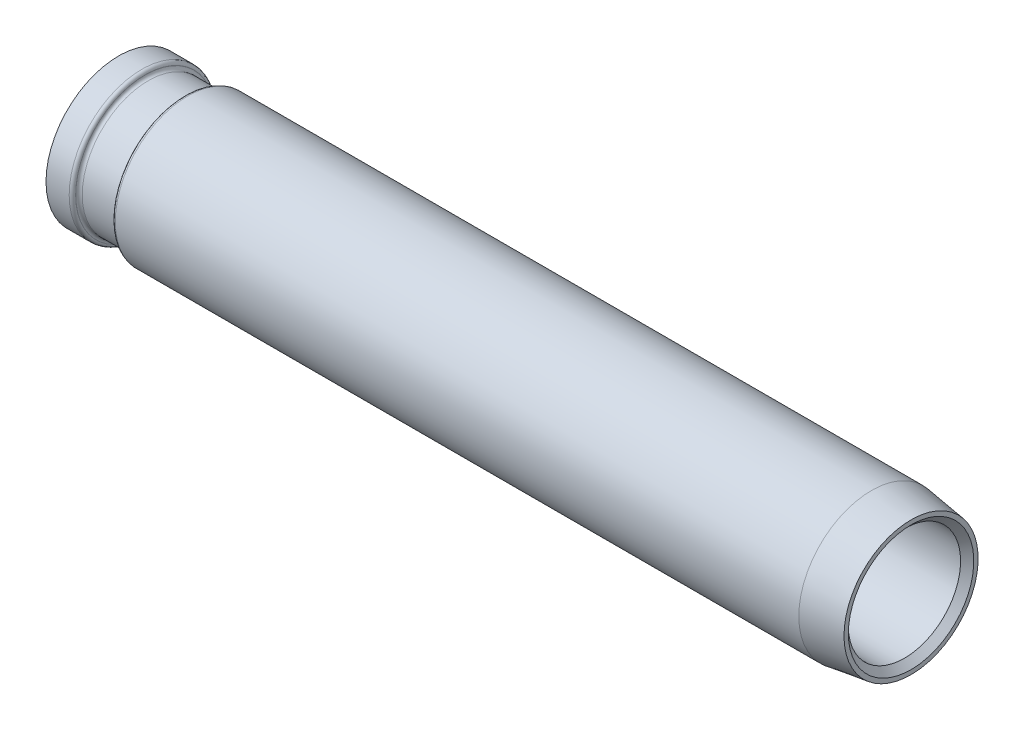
ISO-10303-21;
HEADER;
FILE_DESCRIPTION(('STEP AP214'),'2;1');
FILE_NAME('part.step','',(''),(''),'','','');
FILE_SCHEMA(('AUTOMOTIVE_DESIGN { 1 0 10303 214 1 1 1 1 }'));
ENDSEC;
DATA;
#1=APPLICATION_CONTEXT('core data for automotive mechanical design processes');
#2=APPLICATION_PROTOCOL_DEFINITION('international standard','automotive_design',2000,#1);
#3=PRODUCT_CONTEXT('',#1,'mechanical');
#4=PRODUCT('Part','Part','',(#3));
#5=PRODUCT_RELATED_PRODUCT_CATEGORY('part','',(#4));
#6=PRODUCT_DEFINITION_FORMATION('','',#4);
#7=PRODUCT_DEFINITION_CONTEXT('part definition',#1,'design');
#8=PRODUCT_DEFINITION('design','',#6,#7);
#9=PRODUCT_DEFINITION_SHAPE('','',#8);
#10=(LENGTH_UNIT() NAMED_UNIT(*) SI_UNIT(.MILLI.,.METRE.));
#11=(NAMED_UNIT(*) PLANE_ANGLE_UNIT() SI_UNIT($,.RADIAN.));
#12=(NAMED_UNIT(*) SI_UNIT($,.STERADIAN.) SOLID_ANGLE_UNIT());
#13=UNCERTAINTY_MEASURE_WITH_UNIT(LENGTH_MEASURE(1.E-05),#10,'distance_accuracy_value','');
#14=(GEOMETRIC_REPRESENTATION_CONTEXT(3) GLOBAL_UNCERTAINTY_ASSIGNED_CONTEXT((#13)) GLOBAL_UNIT_ASSIGNED_CONTEXT((#10,
#11,#12)) REPRESENTATION_CONTEXT('',''));
#15=CARTESIAN_POINT('',(0.,0.,0.));
#16=DIRECTION('',(0.,0.,1.));
#17=DIRECTION('',(1.,0.,0.));
#18=AXIS2_PLACEMENT_3D('',#15,#16,#17);
#19=CARTESIAN_POINT('',(-100.055405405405,0.,0.));
#20=DIRECTION('',(-1.,0.,0.));
#21=DIRECTION('',(0.,0.,1.));
#22=AXIS2_PLACEMENT_3D('',#19,#20,#21);
#23=CYLINDRICAL_SURFACE('',#22,8.5);
#24=CARTESIAN_POINT('',(-47.3474774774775,0.,0.));
#25=DIRECTION('',(1.,0.,0.));
#26=DIRECTION('',(0.,0.,-1.));
#27=AXIS2_PLACEMENT_3D('',#24,#25,#26);
#28=CIRCLE('',#27,8.5);
#29=CARTESIAN_POINT('',(-47.3474774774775,0.,-8.5));
#30=VERTEX_POINT('',#29);
#31=EDGE_CURVE('E55',#30,#30,#28,.F.);
#32=ORIENTED_EDGE('',*,*,#31,.T.);
#33=EDGE_LOOP('',(#32));
#34=FACE_BOUND('',#33,.T.);
#35=CARTESIAN_POINT('',(-44.8374774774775,0.,0.));
#36=DIRECTION('',(-1.,0.,0.));
#37=DIRECTION('',(0.,0.,1.));
#38=AXIS2_PLACEMENT_3D('',#35,#36,#37);
#39=CIRCLE('',#38,8.5);
#40=CARTESIAN_POINT('',(-44.8374774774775,0.,8.5));
#41=VERTEX_POINT('',#40);
#42=EDGE_CURVE('E106',#41,#41,#39,.T.);
#43=ORIENTED_EDGE('',*,*,#42,.F.);
#44=EDGE_LOOP('',(#43));
#45=FACE_BOUND('',#44,.T.);
#46=ADVANCED_FACE('F33',(#34,#45),#23,.F.);
#47=CARTESIAN_POINT('',(-48.3474774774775,11.,0.));
#48=DIRECTION('',(1.,0.,0.));
#49=DIRECTION('',(0.,0.,-1.));
#50=AXIS2_PLACEMENT_3D('',#47,#48,#49);
#51=PLANE('',#50);
#52=CARTESIAN_POINT('',(-48.3474774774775,0.,0.));
#53=DIRECTION('',(1.,0.,0.));
#54=DIRECTION('',(0.,0.,-1.));
#55=AXIS2_PLACEMENT_3D('',#52,#53,#54);
#56=CIRCLE('',#55,9.49999999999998);
#57=CARTESIAN_POINT('',(-48.3474774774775,0.,-9.49999999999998));
#58=VERTEX_POINT('',#57);
#59=EDGE_CURVE('E52',#58,#58,#56,.T.);
#60=ORIENTED_EDGE('',*,*,#59,.T.);
#61=EDGE_LOOP('',(#60));
#62=FACE_BOUND('',#61,.T.);
#63=CARTESIAN_POINT('',(-48.3474774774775,0.,0.));
#64=DIRECTION('',(-1.,0.,0.));
#65=DIRECTION('',(0.,0.,1.));
#66=AXIS2_PLACEMENT_3D('',#63,#64,#65);
#67=CIRCLE('',#66,11.);
#68=CARTESIAN_POINT('',(-48.3474774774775,0.,11.));
#69=VERTEX_POINT('',#68);
#70=EDGE_CURVE('E58',#69,#69,#67,.T.);
#71=ORIENTED_EDGE('',*,*,#70,.T.);
#72=EDGE_LOOP('',(#71));
#73=FACE_BOUND('',#72,.T.);
#74=ADVANCED_FACE('F113',(#62,#73),#51,.F.);
#75=CARTESIAN_POINT('',(-100.055405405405,0.,0.));
#76=DIRECTION('',(-1.,0.,0.));
#77=DIRECTION('',(0.,0.,1.));
#78=AXIS2_PLACEMENT_3D('',#75,#76,#77);
#79=CYLINDRICAL_SURFACE('',#78,11.);
#80=ORIENTED_EDGE('',*,*,#70,.F.);
#81=EDGE_LOOP('',(#80));
#82=FACE_BOUND('',#81,.T.);
#83=CARTESIAN_POINT('',(-44.8374774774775,0.,0.));
#84=DIRECTION('',(-1.,0.,0.));
#85=DIRECTION('',(0.,0.,1.));
#86=AXIS2_PLACEMENT_3D('',#83,#84,#85);
#87=CIRCLE('',#86,11.);
#88=CARTESIAN_POINT('',(-44.8374774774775,0.,11.));
#89=VERTEX_POINT('',#88);
#90=EDGE_CURVE('E61',#89,#89,#87,.T.);
#91=ORIENTED_EDGE('',*,*,#90,.T.);
#92=EDGE_LOOP('',(#91));
#93=FACE_BOUND('',#92,.T.);
#94=ADVANCED_FACE('F118',(#82,#93),#79,.T.);
#95=CARTESIAN_POINT('',(-44.8374774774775,0.,0.));
#96=DIRECTION('',(-1.,0.,0.));
#97=DIRECTION('',(0.,0.,1.));
#98=AXIS2_PLACEMENT_3D('',#95,#96,#97);
#99=TOROIDAL_SURFACE('',#98,10.51,0.489999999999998);
#100=ORIENTED_EDGE('',*,*,#90,.F.);
#101=EDGE_LOOP('',(#100));
#102=FACE_BOUND('',#101,.T.);
#103=CARTESIAN_POINT('',(-44.3474774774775,0.,0.));
#104=DIRECTION('',(-1.,0.,0.));
#105=DIRECTION('',(0.,0.,1.));
#106=AXIS2_PLACEMENT_3D('',#103,#104,#105);
#107=CIRCLE('',#106,10.51);
#108=CARTESIAN_POINT('',(-44.3474774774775,0.,10.51));
#109=VERTEX_POINT('',#108);
#110=EDGE_CURVE('E64',#109,#109,#107,.T.);
#111=ORIENTED_EDGE('',*,*,#110,.T.);
#112=EDGE_LOOP('',(#111));
#113=FACE_BOUND('',#112,.T.);
#114=ADVANCED_FACE('F196',(#102,#113),#99,.T.);
#115=CARTESIAN_POINT('',(-44.3474774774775,10.51,0.));
#116=DIRECTION('',(-1.,0.,0.));
#117=DIRECTION('',(0.,0.,1.));
#118=AXIS2_PLACEMENT_3D('',#115,#116,#117);
#119=PLANE('',#118);
#120=ORIENTED_EDGE('',*,*,#110,.F.);
#121=EDGE_LOOP('',(#120));
#122=FACE_BOUND('',#121,.T.);
#123=CARTESIAN_POINT('',(-44.3474774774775,0.,0.));
#124=DIRECTION('',(-1.,0.,0.));
#125=DIRECTION('',(0.,0.,1.));
#126=AXIS2_PLACEMENT_3D('',#123,#124,#125);
#127=CIRCLE('',#126,10.49);
#128=CARTESIAN_POINT('',(-44.3474774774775,0.,10.49));
#129=VERTEX_POINT('',#128);
#130=EDGE_CURVE('E67',#129,#129,#127,.T.);
#131=ORIENTED_EDGE('',*,*,#130,.T.);
#132=EDGE_LOOP('',(#131));
#133=FACE_BOUND('',#132,.T.);
#134=ADVANCED_FACE('F192',(#122,#133),#119,.F.);
#135=CARTESIAN_POINT('',(-43.8574774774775,0.,0.));
#136=DIRECTION('',(-1.,0.,0.));
#137=DIRECTION('',(0.,0.,1.));
#138=AXIS2_PLACEMENT_3D('',#135,#136,#137);
#139=TOROIDAL_SURFACE('',#138,10.49,0.489999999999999);
#140=ORIENTED_EDGE('',*,*,#130,.F.);
#141=EDGE_LOOP('',(#140));
#142=FACE_BOUND('',#141,.T.);
#143=CARTESIAN_POINT('',(-43.8574774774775,0.,0.));
#144=DIRECTION('',(-1.,0.,0.));
#145=DIRECTION('',(0.,0.,1.));
#146=AXIS2_PLACEMENT_3D('',#143,#144,#145);
#147=CIRCLE('',#146,10.);
#148=CARTESIAN_POINT('',(-43.8574774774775,0.,10.));
#149=VERTEX_POINT('',#148);
#150=EDGE_CURVE('E70',#149,#149,#147,.T.);
#151=ORIENTED_EDGE('',*,*,#150,.T.);
#152=EDGE_LOOP('',(#151));
#153=FACE_BOUND('',#152,.T.);
#154=ADVANCED_FACE('F188',(#142,#153),#139,.F.);
#155=CARTESIAN_POINT('',(-100.055405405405,0.,0.));
#156=DIRECTION('',(-1.,0.,0.));
#157=DIRECTION('',(0.,0.,1.));
#158=AXIS2_PLACEMENT_3D('',#155,#156,#157);
#159=CYLINDRICAL_SURFACE('',#158,10.);
#160=ORIENTED_EDGE('',*,*,#150,.F.);
#161=EDGE_LOOP('',(#160));
#162=FACE_BOUND('',#161,.T.);
#163=CARTESIAN_POINT('',(-38.8374774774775,0.,0.));
#164=DIRECTION('',(-1.,0.,0.));
#165=DIRECTION('',(0.,0.,1.));
#166=AXIS2_PLACEMENT_3D('',#163,#164,#165);
#167=CIRCLE('',#166,10.);
#168=CARTESIAN_POINT('',(-38.8374774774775,0.,10.));
#169=VERTEX_POINT('',#168);
#170=EDGE_CURVE('E73',#169,#169,#167,.T.);
#171=ORIENTED_EDGE('',*,*,#170,.T.);
#172=EDGE_LOOP('',(#171));
#173=FACE_BOUND('',#172,.T.);
#174=ADVANCED_FACE('F184',(#162,#173),#159,.T.);
#175=CARTESIAN_POINT('',(-38.8374774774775,0.,0.));
#176=DIRECTION('',(-1.,0.,0.));
#177=DIRECTION('',(0.,0.,1.));
#178=AXIS2_PLACEMENT_3D('',#175,#176,#177);
#179=TOROIDAL_SURFACE('',#178,10.49,0.489999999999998);
#180=ORIENTED_EDGE('',*,*,#170,.F.);
#181=EDGE_LOOP('',(#180));
#182=FACE_BOUND('',#181,.T.);
#183=CARTESIAN_POINT('',(-38.3474774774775,0.,0.));
#184=DIRECTION('',(-1.,0.,0.));
#185=DIRECTION('',(0.,0.,1.));
#186=AXIS2_PLACEMENT_3D('',#183,#184,#185);
#187=CIRCLE('',#186,10.49);
#188=CARTESIAN_POINT('',(-38.3474774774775,0.,10.49));
#189=VERTEX_POINT('',#188);
#190=EDGE_CURVE('E76',#189,#189,#187,.T.);
#191=ORIENTED_EDGE('',*,*,#190,.T.);
#192=EDGE_LOOP('',(#191));
#193=FACE_BOUND('',#192,.T.);
#194=ADVANCED_FACE('F180',(#182,#193),#179,.F.);
#195=CARTESIAN_POINT('',(-38.3474774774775,10.51,0.));
#196=DIRECTION('',(1.,0.,0.));
#197=DIRECTION('',(0.,0.,-1.));
#198=AXIS2_PLACEMENT_3D('',#195,#196,#197);
#199=PLANE('',#198);
#200=ORIENTED_EDGE('',*,*,#190,.F.);
#201=EDGE_LOOP('',(#200));
#202=FACE_BOUND('',#201,.T.);
#203=CARTESIAN_POINT('',(-38.3474774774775,0.,0.));
#204=DIRECTION('',(-1.,0.,0.));
#205=DIRECTION('',(0.,0.,1.));
#206=AXIS2_PLACEMENT_3D('',#203,#204,#205);
#207=CIRCLE('',#206,10.51);
#208=CARTESIAN_POINT('',(-38.3474774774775,0.,10.51));
#209=VERTEX_POINT('',#208);
#210=EDGE_CURVE('E79',#209,#209,#207,.T.);
#211=ORIENTED_EDGE('',*,*,#210,.T.);
#212=EDGE_LOOP('',(#211));
#213=FACE_BOUND('',#212,.T.);
#214=ADVANCED_FACE('F176',(#202,#213),#199,.F.);
#215=CARTESIAN_POINT('',(-37.8574774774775,0.,0.));
#216=DIRECTION('',(-1.,0.,0.));
#217=DIRECTION('',(0.,0.,1.));
#218=AXIS2_PLACEMENT_3D('',#215,#216,#217);
#219=TOROIDAL_SURFACE('',#218,10.51,0.489999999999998);
#220=ORIENTED_EDGE('',*,*,#210,.F.);
#221=EDGE_LOOP('',(#220));
#222=FACE_BOUND('',#221,.T.);
#223=CARTESIAN_POINT('',(-37.8574774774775,0.,0.));
#224=DIRECTION('',(-1.,0.,0.));
#225=DIRECTION('',(0.,0.,1.));
#226=AXIS2_PLACEMENT_3D('',#223,#224,#225);
#227=CIRCLE('',#226,11.);
#228=CARTESIAN_POINT('',(-37.8574774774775,0.,11.));
#229=VERTEX_POINT('',#228);
#230=EDGE_CURVE('E82',#229,#229,#227,.T.);
#231=ORIENTED_EDGE('',*,*,#230,.T.);
#232=EDGE_LOOP('',(#231));
#233=FACE_BOUND('',#232,.T.);
#234=ADVANCED_FACE('F173',(#222,#233),#219,.T.);
#235=CARTESIAN_POINT('',(-100.055405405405,0.,0.));
#236=DIRECTION('',(-1.,0.,0.));
#237=DIRECTION('',(0.,0.,1.));
#238=AXIS2_PLACEMENT_3D('',#235,#236,#237);
#239=CYLINDRICAL_SURFACE('',#238,11.);
#240=CARTESIAN_POINT('',(65.6525225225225,0.,0.));
#241=DIRECTION('',(-1.,0.,0.));
#242=DIRECTION('',(0.,0.,1.));
#243=AXIS2_PLACEMENT_3D('',#240,#241,#242);
#244=CIRCLE('',#243,11.);
#245=CARTESIAN_POINT('',(65.6525225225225,0.,11.));
#246=VERTEX_POINT('',#245);
#247=EDGE_CURVE('E39',#246,#246,#244,.T.);
#248=ORIENTED_EDGE('',*,*,#247,.T.);
#249=EDGE_LOOP('',(#248));
#250=FACE_BOUND('',#249,.T.);
#251=ORIENTED_EDGE('',*,*,#230,.F.);
#252=EDGE_LOOP('',(#251));
#253=FACE_BOUND('',#252,.T.);
#254=ADVANCED_FACE('F170',(#250,#253),#239,.T.);
#255=CARTESIAN_POINT('',(71.6525225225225,11.,0.));
#256=DIRECTION('',(-1.,0.,0.));
#257=DIRECTION('',(0.,0.,1.));
#258=AXIS2_PLACEMENT_3D('',#255,#256,#257);
#259=PLANE('',#258);
#260=CARTESIAN_POINT('',(71.6525225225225,0.,0.));
#261=DIRECTION('',(-1.,0.,0.));
#262=DIRECTION('',(0.,0.,1.));
#263=AXIS2_PLACEMENT_3D('',#260,#261,#262);
#264=CIRCLE('',#263,10.1567549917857);
#265=CARTESIAN_POINT('',(71.6525225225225,0.,10.1567549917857));
#266=VERTEX_POINT('',#265);
#267=EDGE_CURVE('E10',#266,#266,#264,.F.);
#268=ORIENTED_EDGE('',*,*,#267,.T.);
#269=EDGE_LOOP('',(#268));
#270=FACE_BOUND('',#269,.T.);
#271=CARTESIAN_POINT('',(71.6525225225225,0.,0.));
#272=DIRECTION('',(-1.,0.,0.));
#273=DIRECTION('',(0.,0.,1.));
#274=AXIS2_PLACEMENT_3D('',#271,#272,#273);
#275=CIRCLE('',#274,9.49999999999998);
#276=CARTESIAN_POINT('',(71.6525225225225,0.,9.49999999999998));
#277=VERTEX_POINT('',#276);
#278=EDGE_CURVE('E47',#277,#277,#275,.T.);
#279=ORIENTED_EDGE('',*,*,#278,.T.);
#280=EDGE_LOOP('',(#279));
#281=FACE_BOUND('',#280,.T.);
#282=ADVANCED_FACE('F166',(#270,#281),#259,.F.);
#283=CARTESIAN_POINT('',(-100.055405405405,0.,0.));
#284=DIRECTION('',(-1.,0.,0.));
#285=DIRECTION('',(0.,0.,1.));
#286=AXIS2_PLACEMENT_3D('',#283,#284,#285);
#287=CYLINDRICAL_SURFACE('',#286,8.5);
#288=CARTESIAN_POINT('',(70.6525225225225,0.,0.));
#289=DIRECTION('',(-1.,0.,0.));
#290=DIRECTION('',(0.,0.,1.));
#291=AXIS2_PLACEMENT_3D('',#288,#289,#290);
#292=CIRCLE('',#291,8.5);
#293=CARTESIAN_POINT('',(70.6525225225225,0.,8.5));
#294=VERTEX_POINT('',#293);
#295=EDGE_CURVE('E43',#294,#294,#292,.F.);
#296=ORIENTED_EDGE('',*,*,#295,.T.);
#297=EDGE_LOOP('',(#296));
#298=FACE_BOUND('',#297,.T.);
#299=CARTESIAN_POINT('',(-37.8474774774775,0.,0.));
#300=DIRECTION('',(-1.,0.,0.));
#301=DIRECTION('',(0.,0.,1.));
#302=AXIS2_PLACEMENT_3D('',#299,#300,#301);
#303=CIRCLE('',#302,8.5);
#304=CARTESIAN_POINT('',(-37.8474774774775,0.,8.5));
#305=VERTEX_POINT('',#304);
#306=EDGE_CURVE('E85',#305,#305,#303,.T.);
#307=ORIENTED_EDGE('',*,*,#306,.T.);
#308=EDGE_LOOP('',(#307));
#309=FACE_BOUND('',#308,.T.);
#310=ADVANCED_FACE('F162',(#298,#309),#287,.F.);
#311=CARTESIAN_POINT('',(-37.8474774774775,0.,0.));
#312=DIRECTION('',(-1.,0.,0.));
#313=DIRECTION('',(0.,0.,1.));
#314=AXIS2_PLACEMENT_3D('',#311,#312,#313);
#315=TOROIDAL_SURFACE('',#314,8.,0.500000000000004);
#316=ORIENTED_EDGE('',*,*,#306,.F.);
#317=EDGE_LOOP('',(#316));
#318=FACE_BOUND('',#317,.T.);
#319=CARTESIAN_POINT('',(-38.3474774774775,0.,0.));
#320=DIRECTION('',(-1.,0.,0.));
#321=DIRECTION('',(0.,0.,1.));
#322=AXIS2_PLACEMENT_3D('',#319,#320,#321);
#323=CIRCLE('',#322,8.);
#324=CARTESIAN_POINT('',(-38.3474774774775,0.,8.));
#325=VERTEX_POINT('',#324);
#326=EDGE_CURVE('E88',#325,#325,#323,.T.);
#327=ORIENTED_EDGE('',*,*,#326,.T.);
#328=EDGE_LOOP('',(#327));
#329=FACE_BOUND('',#328,.T.);
#330=ADVANCED_FACE('F158',(#318,#329),#315,.F.);
#331=CARTESIAN_POINT('',(-38.3474774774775,7.99061857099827,0.));
#332=DIRECTION('',(-1.,0.,0.));
#333=DIRECTION('',(0.,0.,1.));
#334=AXIS2_PLACEMENT_3D('',#331,#332,#333);
#335=PLANE('',#334);
#336=ORIENTED_EDGE('',*,*,#326,.F.);
#337=EDGE_LOOP('',(#336));
#338=FACE_BOUND('',#337,.T.);
#339=CARTESIAN_POINT('',(-38.3474774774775,0.,0.));
#340=DIRECTION('',(-1.,0.,0.));
#341=DIRECTION('',(0.,0.,1.));
#342=AXIS2_PLACEMENT_3D('',#339,#340,#341);
#343=CIRCLE('',#342,7.99061857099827);
#344=CARTESIAN_POINT('',(-38.3474774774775,0.,7.99061857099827));
#345=VERTEX_POINT('',#344);
#346=EDGE_CURVE('E91',#345,#345,#343,.T.);
#347=ORIENTED_EDGE('',*,*,#346,.T.);
#348=EDGE_LOOP('',(#347));
#349=FACE_BOUND('',#348,.T.);
#350=ADVANCED_FACE('F154',(#338,#349),#335,.F.);
#351=CARTESIAN_POINT('',(-38.8374774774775,0.,0.));
#352=DIRECTION('',(-1.,0.,0.));
#353=DIRECTION('',(0.,0.,1.));
#354=AXIS2_PLACEMENT_3D('',#351,#352,#353);
#355=TOROIDAL_SURFACE('',#354,7.99061857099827,0.489999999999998);
#356=ORIENTED_EDGE('',*,*,#346,.F.);
#357=EDGE_LOOP('',(#356));
#358=FACE_BOUND('',#357,.T.);
#359=CARTESIAN_POINT('',(-38.8374774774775,0.,0.));
#360=DIRECTION('',(-1.,0.,0.));
#361=DIRECTION('',(0.,0.,1.));
#362=AXIS2_PLACEMENT_3D('',#359,#360,#361);
#363=CIRCLE('',#362,7.50061857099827);
#364=CARTESIAN_POINT('',(-38.8374774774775,0.,7.50061857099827));
#365=VERTEX_POINT('',#364);
#366=EDGE_CURVE('E94',#365,#365,#363,.T.);
#367=ORIENTED_EDGE('',*,*,#366,.T.);
#368=EDGE_LOOP('',(#367));
#369=FACE_BOUND('',#368,.T.);
#370=ADVANCED_FACE('F150',(#358,#369),#355,.T.);
#371=CARTESIAN_POINT('',(-100.055405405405,0.,0.));
#372=DIRECTION('',(-1.,0.,0.));
#373=DIRECTION('',(0.,0.,1.));
#374=AXIS2_PLACEMENT_3D('',#371,#372,#373);
#375=CYLINDRICAL_SURFACE('',#374,7.50061857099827);
#376=ORIENTED_EDGE('',*,*,#366,.F.);
#377=EDGE_LOOP('',(#376));
#378=FACE_BOUND('',#377,.T.);
#379=CARTESIAN_POINT('',(-43.8474774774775,0.,0.));
#380=DIRECTION('',(-1.,0.,0.));
#381=DIRECTION('',(0.,0.,1.));
#382=AXIS2_PLACEMENT_3D('',#379,#380,#381);
#383=CIRCLE('',#382,7.50061857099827);
#384=CARTESIAN_POINT('',(-43.8474774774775,0.,7.50061857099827));
#385=VERTEX_POINT('',#384);
#386=EDGE_CURVE('E97',#385,#385,#383,.T.);
#387=ORIENTED_EDGE('',*,*,#386,.T.);
#388=EDGE_LOOP('',(#387));
#389=FACE_BOUND('',#388,.T.);
#390=ADVANCED_FACE('F146',(#378,#389),#375,.F.);
#391=CARTESIAN_POINT('',(-43.8474774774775,0.,0.));
#392=DIRECTION('',(-1.,0.,0.));
#393=DIRECTION('',(0.,0.,1.));
#394=AXIS2_PLACEMENT_3D('',#391,#392,#393);
#395=TOROIDAL_SURFACE('',#394,8.00061857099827,0.5);
#396=ORIENTED_EDGE('',*,*,#386,.F.);
#397=EDGE_LOOP('',(#396));
#398=FACE_BOUND('',#397,.T.);
#399=CARTESIAN_POINT('',(-44.3474774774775,0.,0.));
#400=DIRECTION('',(-1.,0.,0.));
#401=DIRECTION('',(0.,0.,1.));
#402=AXIS2_PLACEMENT_3D('',#399,#400,#401);
#403=CIRCLE('',#402,8.00061857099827);
#404=CARTESIAN_POINT('',(-44.3474774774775,0.,8.00061857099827));
#405=VERTEX_POINT('',#404);
#406=EDGE_CURVE('E100',#405,#405,#403,.T.);
#407=ORIENTED_EDGE('',*,*,#406,.T.);
#408=EDGE_LOOP('',(#407));
#409=FACE_BOUND('',#408,.T.);
#410=ADVANCED_FACE('F142',(#398,#409),#395,.T.);
#411=CARTESIAN_POINT('',(-44.3474774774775,8.00061857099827,0.));
#412=DIRECTION('',(1.,0.,0.));
#413=DIRECTION('',(0.,0.,-1.));
#414=AXIS2_PLACEMENT_3D('',#411,#412,#413);
#415=PLANE('',#414);
#416=ORIENTED_EDGE('',*,*,#406,.F.);
#417=EDGE_LOOP('',(#416));
#418=FACE_BOUND('',#417,.T.);
#419=CARTESIAN_POINT('',(-44.3474774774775,0.,0.));
#420=DIRECTION('',(-1.,0.,0.));
#421=DIRECTION('',(0.,0.,1.));
#422=AXIS2_PLACEMENT_3D('',#419,#420,#421);
#423=CIRCLE('',#422,8.01);
#424=CARTESIAN_POINT('',(-44.3474774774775,0.,8.01));
#425=VERTEX_POINT('',#424);
#426=EDGE_CURVE('E103',#425,#425,#423,.T.);
#427=ORIENTED_EDGE('',*,*,#426,.T.);
#428=EDGE_LOOP('',(#427));
#429=FACE_BOUND('',#428,.T.);
#430=ADVANCED_FACE('F134',(#418,#429),#415,.F.);
#431=CARTESIAN_POINT('',(-44.8374774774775,0.,0.));
#432=DIRECTION('',(-1.,0.,0.));
#433=DIRECTION('',(0.,0.,1.));
#434=AXIS2_PLACEMENT_3D('',#431,#432,#433);
#435=TOROIDAL_SURFACE('',#434,8.01,0.489999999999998);
#436=ORIENTED_EDGE('',*,*,#426,.F.);
#437=EDGE_LOOP('',(#436));
#438=FACE_BOUND('',#437,.T.);
#439=ORIENTED_EDGE('',*,*,#42,.T.);
#440=EDGE_LOOP('',(#439));
#441=FACE_BOUND('',#440,.T.);
#442=ADVANCED_FACE('F110',(#438,#441),#435,.F.);
#443=CARTESIAN_POINT('',(-47.3474774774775,0.,0.));
#444=DIRECTION('',(-1.,0.,0.));
#445=DIRECTION('',(0.,0.,1.));
#446=AXIS2_PLACEMENT_3D('',#443,#444,#445);
#447=CONICAL_SURFACE('',#446,8.5,0.785398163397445);
#448=ORIENTED_EDGE('',*,*,#59,.F.);
#449=EDGE_LOOP('',(#448));
#450=FACE_BOUND('',#449,.T.);
#451=ORIENTED_EDGE('',*,*,#31,.F.);
#452=EDGE_LOOP('',(#451));
#453=FACE_BOUND('',#452,.T.);
#454=ADVANCED_FACE('F122',(#450,#453),#447,.F.);
#455=CARTESIAN_POINT('',(71.6525225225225,0.,0.));
#456=DIRECTION('',(1.,0.,0.));
#457=DIRECTION('',(0.,0.,-1.));
#458=AXIS2_PLACEMENT_3D('',#455,#456,#457);
#459=CONICAL_SURFACE('',#458,9.49999999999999,0.785398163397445);
#460=ORIENTED_EDGE('',*,*,#295,.F.);
#461=EDGE_LOOP('',(#460));
#462=FACE_BOUND('',#461,.T.);
#463=ORIENTED_EDGE('',*,*,#278,.F.);
#464=EDGE_LOOP('',(#463));
#465=FACE_BOUND('',#464,.T.);
#466=ADVANCED_FACE('F124',(#462,#465),#459,.F.);
#467=CARTESIAN_POINT('',(65.6525225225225,0.,0.));
#468=DIRECTION('',(-1.,0.,0.));
#469=DIRECTION('',(0.,0.,1.));
#470=AXIS2_PLACEMENT_3D('',#467,#468,#469);
#471=CONICAL_SURFACE('',#470,11.,0.139626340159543);
#472=ORIENTED_EDGE('',*,*,#267,.F.);
#473=EDGE_LOOP('',(#472));
#474=FACE_BOUND('',#473,.T.);
#475=ORIENTED_EDGE('',*,*,#247,.F.);
#476=EDGE_LOOP('',(#475));
#477=FACE_BOUND('',#476,.T.);
#478=ADVANCED_FACE('F131',(#474,#477),#471,.T.);
#479=CLOSED_SHELL('',(#46,#74,#94,#114,#134,#154,#174,#194,#214,#234,#254,#282,#310,#330,#350,
#370,#390,#410,#430,#442,#454,#466,#478));
#480=MANIFOLD_SOLID_BREP('B2',#479);
#481=ADVANCED_BREP_SHAPE_REPRESENTATION('',(#18,#480),#14);
#482=SHAPE_DEFINITION_REPRESENTATION(#9,#481);
ENDSEC;
END-ISO-10303-21;
